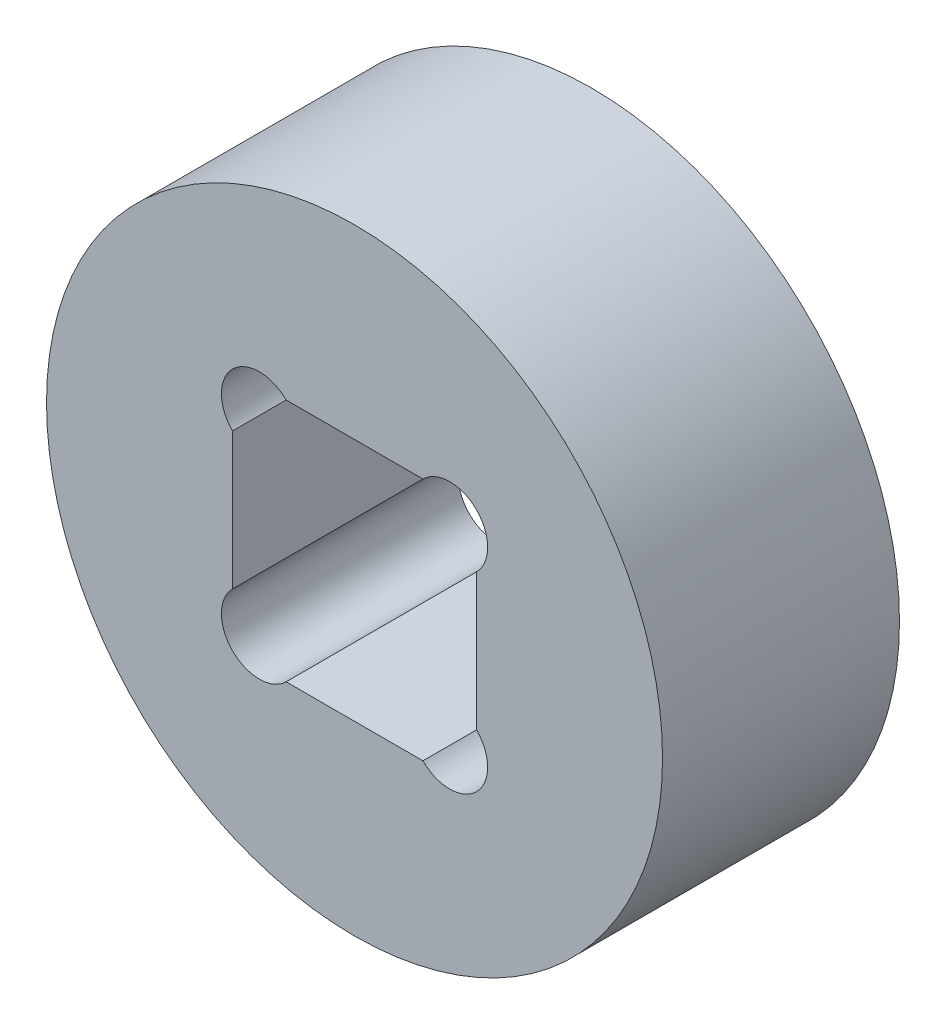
ISO-10303-21;
HEADER;
FILE_DESCRIPTION(('STEP AP214'),'2;1');
FILE_NAME('part.step','',(''),(''),'','','');
FILE_SCHEMA(('AUTOMOTIVE_DESIGN { 1 0 10303 214 1 1 1 1 }'));
ENDSEC;
DATA;
#1=APPLICATION_CONTEXT('core data for automotive mechanical design processes');
#2=APPLICATION_PROTOCOL_DEFINITION('international standard','automotive_design',2000,#1);
#3=PRODUCT_CONTEXT('',#1,'mechanical');
#4=PRODUCT('Part','Part','',(#3));
#5=PRODUCT_RELATED_PRODUCT_CATEGORY('part','',(#4));
#6=PRODUCT_DEFINITION_FORMATION('','',#4);
#7=PRODUCT_DEFINITION_CONTEXT('part definition',#1,'design');
#8=PRODUCT_DEFINITION('design','',#6,#7);
#9=PRODUCT_DEFINITION_SHAPE('','',#8);
#10=(LENGTH_UNIT() NAMED_UNIT(*) SI_UNIT(.MILLI.,.METRE.));
#11=(NAMED_UNIT(*) PLANE_ANGLE_UNIT() SI_UNIT($,.RADIAN.));
#12=(NAMED_UNIT(*) SI_UNIT($,.STERADIAN.) SOLID_ANGLE_UNIT());
#13=UNCERTAINTY_MEASURE_WITH_UNIT(LENGTH_MEASURE(1.E-05),#10,'distance_accuracy_value','');
#14=(GEOMETRIC_REPRESENTATION_CONTEXT(3) GLOBAL_UNCERTAINTY_ASSIGNED_CONTEXT((#13)) GLOBAL_UNIT_ASSIGNED_CONTEXT((#10,
#11,#12)) REPRESENTATION_CONTEXT('',''));
#15=CARTESIAN_POINT('',(0.,0.,0.));
#16=DIRECTION('',(0.,0.,1.));
#17=DIRECTION('',(1.,0.,0.));
#18=AXIS2_PLACEMENT_3D('',#15,#16,#17);
#19=CARTESIAN_POINT('',(0.,0.,10.));
#20=DIRECTION('',(0.,0.,-1.));
#21=DIRECTION('',(-1.,0.,0.));
#22=AXIS2_PLACEMENT_3D('',#19,#20,#21);
#23=CYLINDRICAL_SURFACE('',#22,13.);
#24=CARTESIAN_POINT('',(0.,0.,10.));
#25=DIRECTION('',(0.,0.,1.));
#26=DIRECTION('',(1.,0.,0.));
#27=AXIS2_PLACEMENT_3D('',#24,#25,#26);
#28=CIRCLE('',#27,13.);
#29=CARTESIAN_POINT('',(13.,0.,10.));
#30=VERTEX_POINT('',#29);
#31=EDGE_CURVE('E11',#30,#30,#28,.T.);
#32=ORIENTED_EDGE('',*,*,#31,.F.);
#33=EDGE_LOOP('',(#32));
#34=FACE_BOUND('',#33,.T.);
#35=CARTESIAN_POINT('',(0.,0.,0.));
#36=DIRECTION('',(0.,0.,1.));
#37=DIRECTION('',(1.,0.,0.));
#38=AXIS2_PLACEMENT_3D('',#35,#36,#37);
#39=CIRCLE('',#38,13.);
#40=CARTESIAN_POINT('',(13.,0.,0.));
#41=VERTEX_POINT('',#40);
#42=EDGE_CURVE('E35',#41,#41,#39,.T.);
#43=ORIENTED_EDGE('',*,*,#42,.T.);
#44=EDGE_LOOP('',(#43));
#45=FACE_BOUND('',#44,.T.);
#46=ADVANCED_FACE('F32',(#34,#45),#23,.T.);
#47=CARTESIAN_POINT('',(0.,0.,10.));
#48=DIRECTION('',(0.,0.,1.));
#49=DIRECTION('',(1.,0.,0.));
#50=AXIS2_PLACEMENT_3D('',#47,#48,#49);
#51=PLANE('',#50);
#52=CARTESIAN_POINT('',(-4.01862915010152,4.01862915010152,10.));
#53=DIRECTION('',(0.,0.,1.));
#54=DIRECTION('',(-1.,0.,0.));
#55=AXIS2_PLACEMENT_3D('',#52,#53,#54);
#56=CIRCLE('',#55,1.6);
#57=CARTESIAN_POINT('',(-2.88725830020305,5.15,10.));
#58=VERTEX_POINT('',#57);
#59=CARTESIAN_POINT('',(-5.15,2.88725830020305,10.));
#60=VERTEX_POINT('',#59);
#61=EDGE_CURVE('E46',#58,#60,#56,.T.);
#62=ORIENTED_EDGE('',*,*,#61,.F.);
#63=DIRECTION('',(-1.,0.,0.));
#64=VECTOR('',#63,1.);
#65=CARTESIAN_POINT('',(-2.88725830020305,5.15,10.));
#66=LINE('',#65,#64);
#67=CARTESIAN_POINT('',(2.88725830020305,5.15,10.));
#68=VERTEX_POINT('',#67);
#69=EDGE_CURVE('E115',#68,#58,#66,.T.);
#70=ORIENTED_EDGE('',*,*,#69,.F.);
#71=CARTESIAN_POINT('',(4.01862915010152,4.01862915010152,10.));
#72=DIRECTION('',(0.,0.,1.));
#73=DIRECTION('',(1.,0.,0.));
#74=AXIS2_PLACEMENT_3D('',#71,#72,#73);
#75=CIRCLE('',#74,1.6);
#76=CARTESIAN_POINT('',(5.15,2.88725830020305,10.));
#77=VERTEX_POINT('',#76);
#78=EDGE_CURVE('E118',#77,#68,#75,.T.);
#79=ORIENTED_EDGE('',*,*,#78,.F.);
#80=DIRECTION('',(0.,1.,0.));
#81=VECTOR('',#80,1.);
#82=CARTESIAN_POINT('',(5.15,2.88725830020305,10.));
#83=LINE('',#82,#81);
#84=CARTESIAN_POINT('',(5.15,-2.88725830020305,10.));
#85=VERTEX_POINT('',#84);
#86=EDGE_CURVE('E146',#85,#77,#83,.T.);
#87=ORIENTED_EDGE('',*,*,#86,.F.);
#88=CARTESIAN_POINT('',(4.01862915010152,-4.01862915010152,10.));
#89=DIRECTION('',(0.,0.,1.));
#90=DIRECTION('',(-1.,0.,0.));
#91=AXIS2_PLACEMENT_3D('',#88,#89,#90);
#92=CIRCLE('',#91,1.6);
#93=CARTESIAN_POINT('',(2.88725830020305,-5.15,10.));
#94=VERTEX_POINT('',#93);
#95=EDGE_CURVE('E143',#94,#85,#92,.T.);
#96=ORIENTED_EDGE('',*,*,#95,.F.);
#97=DIRECTION('',(1.,0.,0.));
#98=VECTOR('',#97,1.);
#99=CARTESIAN_POINT('',(-2.88725830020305,-5.15,10.));
#100=LINE('',#99,#98);
#101=CARTESIAN_POINT('',(-2.88725830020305,-5.15,10.));
#102=VERTEX_POINT('',#101);
#103=EDGE_CURVE('E140',#102,#94,#100,.T.);
#104=ORIENTED_EDGE('',*,*,#103,.F.);
#105=CARTESIAN_POINT('',(-4.01862915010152,-4.01862915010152,10.));
#106=DIRECTION('',(0.,0.,1.));
#107=DIRECTION('',(1.,0.,0.));
#108=AXIS2_PLACEMENT_3D('',#105,#106,#107);
#109=CIRCLE('',#108,1.6);
#110=CARTESIAN_POINT('',(-5.15,-2.88725830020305,10.));
#111=VERTEX_POINT('',#110);
#112=EDGE_CURVE('E137',#111,#102,#109,.T.);
#113=ORIENTED_EDGE('',*,*,#112,.F.);
#114=DIRECTION('',(0.,-1.,0.));
#115=VECTOR('',#114,1.);
#116=CARTESIAN_POINT('',(-5.15,2.88725830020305,10.));
#117=LINE('',#116,#115);
#118=EDGE_CURVE('E135',#60,#111,#117,.T.);
#119=ORIENTED_EDGE('',*,*,#118,.F.);
#120=EDGE_LOOP('',(#62,#70,#79,#87,#96,#104,#113,#119));
#121=FACE_BOUND('',#120,.T.);
#122=ORIENTED_EDGE('',*,*,#31,.T.);
#123=EDGE_LOOP('',(#122));
#124=FACE_BOUND('',#123,.T.);
#125=ADVANCED_FACE('F167',(#121,#124),#51,.T.);
#126=CARTESIAN_POINT('',(0.,0.,0.));
#127=DIRECTION('',(0.,0.,1.));
#128=DIRECTION('',(1.,0.,0.));
#129=AXIS2_PLACEMENT_3D('',#126,#127,#128);
#130=PLANE('',#129);
#131=DIRECTION('',(-1.,0.,0.));
#132=VECTOR('',#131,1.);
#133=CARTESIAN_POINT('',(-2.88725830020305,5.15,0.));
#134=LINE('',#133,#132);
#135=CARTESIAN_POINT('',(2.88725830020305,5.15,0.));
#136=VERTEX_POINT('',#135);
#137=CARTESIAN_POINT('',(-2.88725830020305,5.15,0.));
#138=VERTEX_POINT('',#137);
#139=EDGE_CURVE('E104',#136,#138,#134,.T.);
#140=ORIENTED_EDGE('',*,*,#139,.T.);
#141=CARTESIAN_POINT('',(-4.01862915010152,4.01862915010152,0.));
#142=DIRECTION('',(0.,0.,1.));
#143=DIRECTION('',(-1.,0.,0.));
#144=AXIS2_PLACEMENT_3D('',#141,#142,#143);
#145=CIRCLE('',#144,1.6);
#146=CARTESIAN_POINT('',(-5.15,2.88725830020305,0.));
#147=VERTEX_POINT('',#146);
#148=EDGE_CURVE('E98',#138,#147,#145,.T.);
#149=ORIENTED_EDGE('',*,*,#148,.T.);
#150=DIRECTION('',(0.,-1.,0.));
#151=VECTOR('',#150,1.);
#152=CARTESIAN_POINT('',(-5.15,2.88725830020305,0.));
#153=LINE('',#152,#151);
#154=CARTESIAN_POINT('',(-5.15,-2.88725830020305,0.));
#155=VERTEX_POINT('',#154);
#156=EDGE_CURVE('E107',#147,#155,#153,.T.);
#157=ORIENTED_EDGE('',*,*,#156,.T.);
#158=CARTESIAN_POINT('',(-4.01862915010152,-4.01862915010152,0.));
#159=DIRECTION('',(0.,0.,1.));
#160=DIRECTION('',(1.,0.,0.));
#161=AXIS2_PLACEMENT_3D('',#158,#159,#160);
#162=CIRCLE('',#161,1.6);
#163=CARTESIAN_POINT('',(-2.88725830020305,-5.15,0.));
#164=VERTEX_POINT('',#163);
#165=EDGE_CURVE('E54',#155,#164,#162,.T.);
#166=ORIENTED_EDGE('',*,*,#165,.T.);
#167=DIRECTION('',(1.,0.,0.));
#168=VECTOR('',#167,1.);
#169=CARTESIAN_POINT('',(-2.88725830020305,-5.15,0.));
#170=LINE('',#169,#168);
#171=CARTESIAN_POINT('',(2.88725830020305,-5.15,0.));
#172=VERTEX_POINT('',#171);
#173=EDGE_CURVE('E122',#164,#172,#170,.T.);
#174=ORIENTED_EDGE('',*,*,#173,.T.);
#175=CARTESIAN_POINT('',(4.01862915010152,-4.01862915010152,0.));
#176=DIRECTION('',(0.,0.,1.));
#177=DIRECTION('',(-1.,0.,0.));
#178=AXIS2_PLACEMENT_3D('',#175,#176,#177);
#179=CIRCLE('',#178,1.6);
#180=CARTESIAN_POINT('',(5.15,-2.88725830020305,0.));
#181=VERTEX_POINT('',#180);
#182=EDGE_CURVE('E125',#172,#181,#179,.T.);
#183=ORIENTED_EDGE('',*,*,#182,.T.);
#184=DIRECTION('',(0.,1.,0.));
#185=VECTOR('',#184,1.);
#186=CARTESIAN_POINT('',(5.15,2.88725830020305,0.));
#187=LINE('',#186,#185);
#188=CARTESIAN_POINT('',(5.15,2.88725830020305,0.));
#189=VERTEX_POINT('',#188);
#190=EDGE_CURVE('E128',#181,#189,#187,.T.);
#191=ORIENTED_EDGE('',*,*,#190,.T.);
#192=CARTESIAN_POINT('',(4.01862915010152,4.01862915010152,0.));
#193=DIRECTION('',(0.,0.,1.));
#194=DIRECTION('',(1.,0.,0.));
#195=AXIS2_PLACEMENT_3D('',#192,#193,#194);
#196=CIRCLE('',#195,1.6);
#197=EDGE_CURVE('E131',#189,#136,#196,.T.);
#198=ORIENTED_EDGE('',*,*,#197,.T.);
#199=EDGE_LOOP('',(#140,#149,#157,#166,#174,#183,#191,#198));
#200=FACE_BOUND('',#199,.T.);
#201=ORIENTED_EDGE('',*,*,#42,.F.);
#202=EDGE_LOOP('',(#201));
#203=FACE_BOUND('',#202,.T.);
#204=ADVANCED_FACE('F111',(#200,#203),#130,.F.);
#205=CARTESIAN_POINT('',(-4.01862915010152,4.01862915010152,0.));
#206=DIRECTION('',(0.,0.,1.));
#207=DIRECTION('',(1.,0.,0.));
#208=AXIS2_PLACEMENT_3D('',#205,#206,#207);
#209=CYLINDRICAL_SURFACE('',#208,1.6);
#210=ORIENTED_EDGE('',*,*,#61,.T.);
#211=DIRECTION('',(0.,0.,1.));
#212=VECTOR('',#211,1.);
#213=CARTESIAN_POINT('',(-5.15,2.88725830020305,0.));
#214=LINE('',#213,#212);
#215=EDGE_CURVE('E94',#147,#60,#214,.T.);
#216=ORIENTED_EDGE('',*,*,#215,.F.);
#217=ORIENTED_EDGE('',*,*,#148,.F.);
#218=DIRECTION('',(0.,0.,1.));
#219=VECTOR('',#218,1.);
#220=CARTESIAN_POINT('',(-2.88725830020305,5.15,0.));
#221=LINE('',#220,#219);
#222=EDGE_CURVE('E151',#138,#58,#221,.T.);
#223=ORIENTED_EDGE('',*,*,#222,.T.);
#224=EDGE_LOOP('',(#210,#216,#217,#223));
#225=FACE_BOUND('',#224,.T.);
#226=ADVANCED_FACE('F96',(#225),#209,.F.);
#227=CARTESIAN_POINT('',(-2.88725830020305,5.15,0.));
#228=DIRECTION('',(0.,1.,0.));
#229=DIRECTION('',(0.,0.,1.));
#230=AXIS2_PLACEMENT_3D('',#227,#228,#229);
#231=PLANE('',#230);
#232=ORIENTED_EDGE('',*,*,#69,.T.);
#233=ORIENTED_EDGE('',*,*,#222,.F.);
#234=ORIENTED_EDGE('',*,*,#139,.F.);
#235=DIRECTION('',(0.,0.,1.));
#236=VECTOR('',#235,1.);
#237=CARTESIAN_POINT('',(2.88725830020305,5.15,0.));
#238=LINE('',#237,#236);
#239=EDGE_CURVE('E153',#136,#68,#238,.T.);
#240=ORIENTED_EDGE('',*,*,#239,.T.);
#241=EDGE_LOOP('',(#232,#233,#234,#240));
#242=FACE_BOUND('',#241,.T.);
#243=ADVANCED_FACE('F186',(#242),#231,.F.);
#244=CARTESIAN_POINT('',(4.01862915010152,4.01862915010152,0.));
#245=DIRECTION('',(0.,0.,1.));
#246=DIRECTION('',(1.,0.,0.));
#247=AXIS2_PLACEMENT_3D('',#244,#245,#246);
#248=CYLINDRICAL_SURFACE('',#247,1.6);
#249=ORIENTED_EDGE('',*,*,#78,.T.);
#250=ORIENTED_EDGE('',*,*,#239,.F.);
#251=ORIENTED_EDGE('',*,*,#197,.F.);
#252=DIRECTION('',(0.,0.,1.));
#253=VECTOR('',#252,1.);
#254=CARTESIAN_POINT('',(5.15,2.88725830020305,0.));
#255=LINE('',#254,#253);
#256=EDGE_CURVE('E155',#189,#77,#255,.T.);
#257=ORIENTED_EDGE('',*,*,#256,.T.);
#258=EDGE_LOOP('',(#249,#250,#251,#257));
#259=FACE_BOUND('',#258,.T.);
#260=ADVANCED_FACE('F183',(#259),#248,.F.);
#261=CARTESIAN_POINT('',(5.15,2.88725830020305,0.));
#262=DIRECTION('',(1.,0.,0.));
#263=DIRECTION('',(0.,0.,-1.));
#264=AXIS2_PLACEMENT_3D('',#261,#262,#263);
#265=PLANE('',#264);
#266=ORIENTED_EDGE('',*,*,#86,.T.);
#267=ORIENTED_EDGE('',*,*,#256,.F.);
#268=ORIENTED_EDGE('',*,*,#190,.F.);
#269=DIRECTION('',(0.,0.,1.));
#270=VECTOR('',#269,1.);
#271=CARTESIAN_POINT('',(5.15,-2.88725830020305,0.));
#272=LINE('',#271,#270);
#273=EDGE_CURVE('E157',#181,#85,#272,.T.);
#274=ORIENTED_EDGE('',*,*,#273,.T.);
#275=EDGE_LOOP('',(#266,#267,#268,#274));
#276=FACE_BOUND('',#275,.T.);
#277=ADVANCED_FACE('F179',(#276),#265,.F.);
#278=CARTESIAN_POINT('',(4.01862915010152,-4.01862915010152,0.));
#279=DIRECTION('',(0.,0.,1.));
#280=DIRECTION('',(1.,0.,0.));
#281=AXIS2_PLACEMENT_3D('',#278,#279,#280);
#282=CYLINDRICAL_SURFACE('',#281,1.6);
#283=ORIENTED_EDGE('',*,*,#95,.T.);
#284=ORIENTED_EDGE('',*,*,#273,.F.);
#285=ORIENTED_EDGE('',*,*,#182,.F.);
#286=DIRECTION('',(0.,0.,1.));
#287=VECTOR('',#286,1.);
#288=CARTESIAN_POINT('',(2.88725830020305,-5.15,0.));
#289=LINE('',#288,#287);
#290=EDGE_CURVE('E159',#172,#94,#289,.T.);
#291=ORIENTED_EDGE('',*,*,#290,.T.);
#292=EDGE_LOOP('',(#283,#284,#285,#291));
#293=FACE_BOUND('',#292,.T.);
#294=ADVANCED_FACE('F177',(#293),#282,.F.);
#295=CARTESIAN_POINT('',(-2.88725830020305,-5.15,0.));
#296=DIRECTION('',(0.,-1.,0.));
#297=DIRECTION('',(0.,0.,-1.));
#298=AXIS2_PLACEMENT_3D('',#295,#296,#297);
#299=PLANE('',#298);
#300=ORIENTED_EDGE('',*,*,#103,.T.);
#301=ORIENTED_EDGE('',*,*,#290,.F.);
#302=ORIENTED_EDGE('',*,*,#173,.F.);
#303=DIRECTION('',(0.,0.,1.));
#304=VECTOR('',#303,1.);
#305=CARTESIAN_POINT('',(-2.88725830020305,-5.15,0.));
#306=LINE('',#305,#304);
#307=EDGE_CURVE('E161',#164,#102,#306,.T.);
#308=ORIENTED_EDGE('',*,*,#307,.T.);
#309=EDGE_LOOP('',(#300,#301,#302,#308));
#310=FACE_BOUND('',#309,.T.);
#311=ADVANCED_FACE('F172',(#310),#299,.F.);
#312=CARTESIAN_POINT('',(-4.01862915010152,-4.01862915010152,0.));
#313=DIRECTION('',(0.,0.,1.));
#314=DIRECTION('',(1.,0.,0.));
#315=AXIS2_PLACEMENT_3D('',#312,#313,#314);
#316=CYLINDRICAL_SURFACE('',#315,1.6);
#317=ORIENTED_EDGE('',*,*,#112,.T.);
#318=ORIENTED_EDGE('',*,*,#307,.F.);
#319=ORIENTED_EDGE('',*,*,#165,.F.);
#320=DIRECTION('',(0.,0.,1.));
#321=VECTOR('',#320,1.);
#322=CARTESIAN_POINT('',(-5.15,-2.88725830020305,0.));
#323=LINE('',#322,#321);
#324=EDGE_CURVE('E103',#155,#111,#323,.T.);
#325=ORIENTED_EDGE('',*,*,#324,.T.);
#326=EDGE_LOOP('',(#317,#318,#319,#325));
#327=FACE_BOUND('',#326,.T.);
#328=ADVANCED_FACE('F163',(#327),#316,.F.);
#329=CARTESIAN_POINT('',(-5.15,2.88725830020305,0.));
#330=DIRECTION('',(-1.,0.,0.));
#331=DIRECTION('',(0.,0.,1.));
#332=AXIS2_PLACEMENT_3D('',#329,#330,#331);
#333=PLANE('',#332);
#334=ORIENTED_EDGE('',*,*,#118,.T.);
#335=ORIENTED_EDGE('',*,*,#324,.F.);
#336=ORIENTED_EDGE('',*,*,#156,.F.);
#337=ORIENTED_EDGE('',*,*,#215,.T.);
#338=EDGE_LOOP('',(#334,#335,#336,#337));
#339=FACE_BOUND('',#338,.T.);
#340=ADVANCED_FACE('F108',(#339),#333,.F.);
#341=CLOSED_SHELL('',(#46,#125,#204,#226,#243,#260,#277,#294,#311,#328,#340));
#342=MANIFOLD_SOLID_BREP('B2',#341);
#343=ADVANCED_BREP_SHAPE_REPRESENTATION('',(#18,#342),#14);
#344=SHAPE_DEFINITION_REPRESENTATION(#9,#343);
ENDSEC;
END-ISO-10303-21;
